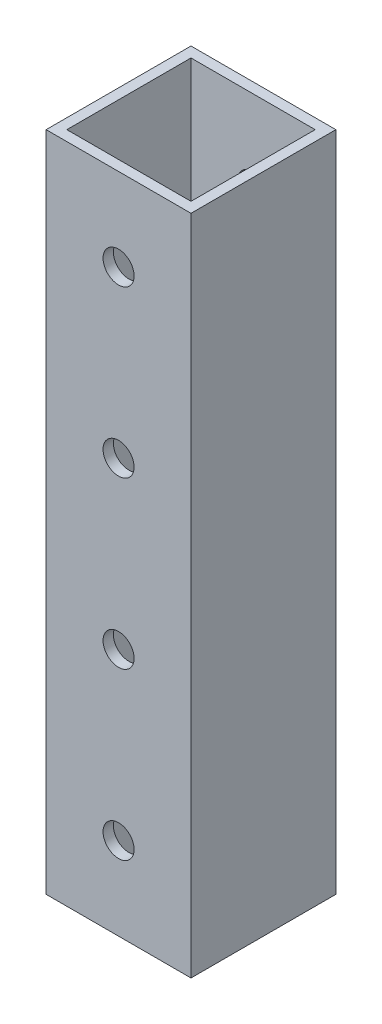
from build123d import *

# Parameters (mm, degrees)
SKETCH1_W           = 44.45
SKETCH1_H           = 44.45
SKETCH1_W_2         = 38.1
SKETCH1_H_2         = 38.1
BOSS_EXTRUDE1_DEPTH = 203.2
SKETCH2_R           = 4.7625
CUT_EXTRUDE1_DEPTH  = 210.958503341


with BuildPart() as part:
    # Sketch1 → Boss-Extrude1 (new body)
    with BuildSketch(Plane(origin=(0, 0, 0), x_dir=(1, 0, 0), z_dir=(0, 1, 0))):
        with Locations((-6.35, -6.35)):
            Rectangle(SKETCH1_W, SKETCH1_H)
        with Locations((-6.35, -6.35)):
            Rectangle(SKETCH1_W_2, SKETCH1_H_2, mode=Mode.SUBTRACT)
    extrude(amount=BOSS_EXTRUDE1_DEPTH)

    # Sketch2 → Cut-Extrude1 (cut, through all)
    with BuildSketch(Plane(origin=(0, 0, -15.875), x_dir=(-1, 0, 0), z_dir=(0, 0, -1))):
        with Locations((6.35, 76.2)):
            Circle(SKETCH2_R)
        with Locations((6.35, 127)):
            Circle(SKETCH2_R)
        with Locations((6.35, 177.8)):
            Circle(SKETCH2_R)
        with Locations((6.35, 25.4)):
            Circle(SKETCH2_R)
    extrude(amount=-CUT_EXTRUDE1_DEPTH, mode=Mode.SUBTRACT)


solid = part.part
